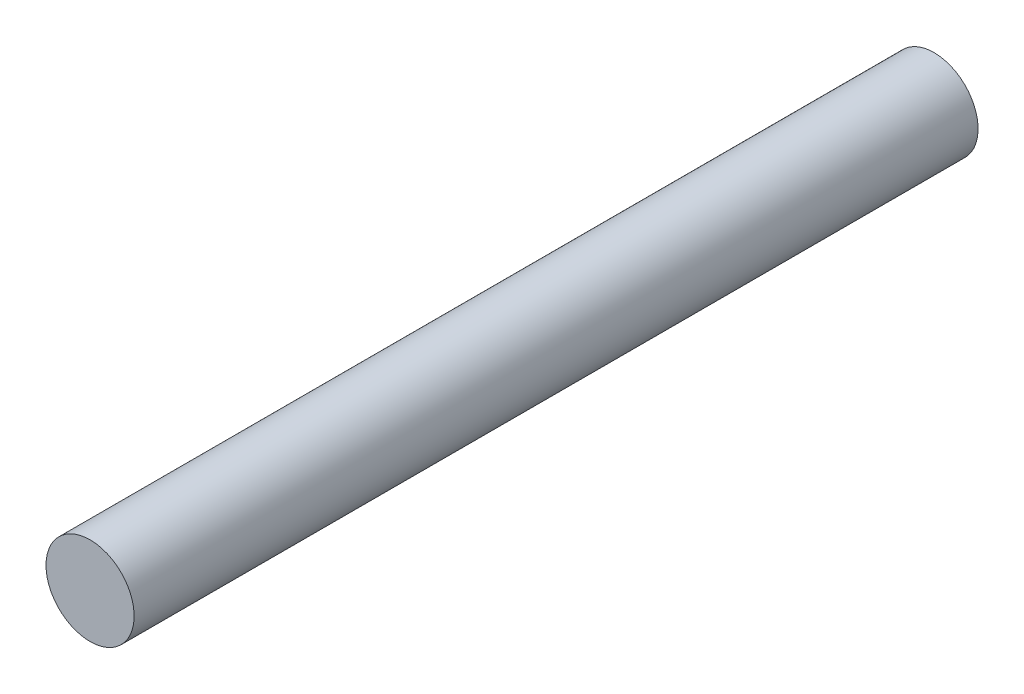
from build123d import *

# Parameters (mm, degrees)
SKETCH1_R           = 3.175
BOSS_EXTRUDE1_DEPTH = 30.4


with BuildPart() as part:
    # Sketch1 → Boss-Extrude1 (new, symmetric)
    with BuildSketch(Plane.XY):
        with Locations(Location((0, 0, 0), (0, 0, 180))):
            Circle(SKETCH1_R)
    extrude(amount=BOSS_EXTRUDE1_DEPTH, both=True)


solid = part.part
